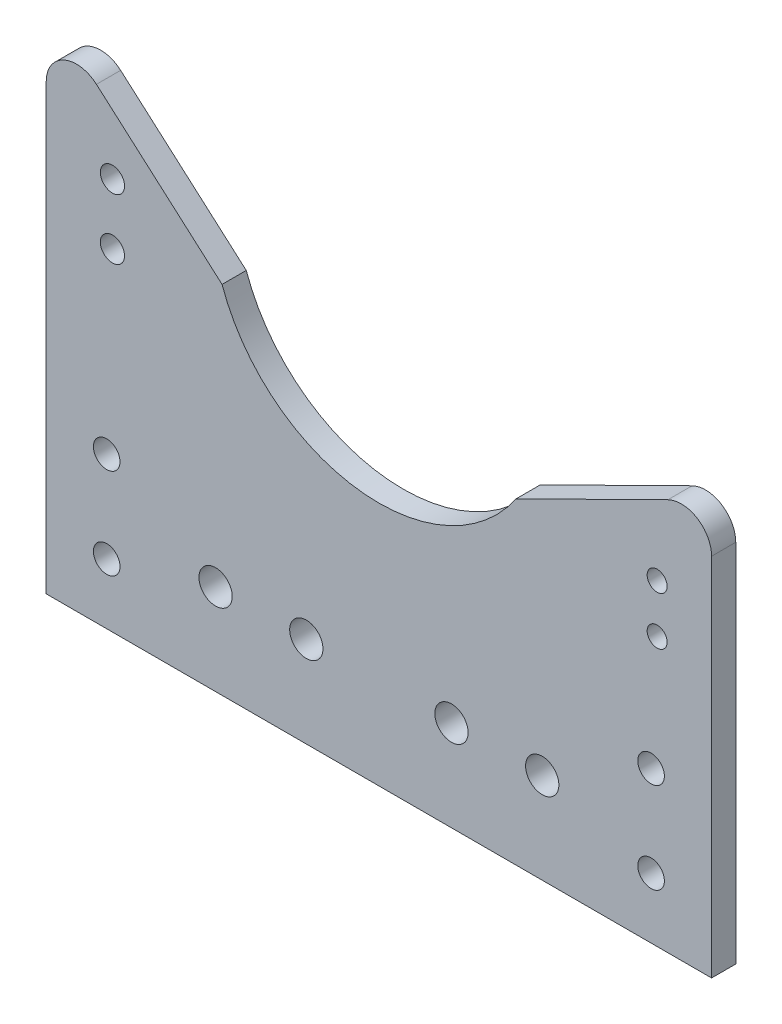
ISO-10303-21;
HEADER;
FILE_DESCRIPTION(('STEP AP214'),'2;1');
FILE_NAME('part.step','',(''),(''),'','','');
FILE_SCHEMA(('AUTOMOTIVE_DESIGN { 1 0 10303 214 1 1 1 1 }'));
ENDSEC;
DATA;
#1=APPLICATION_CONTEXT('core data for automotive mechanical design processes');
#2=APPLICATION_PROTOCOL_DEFINITION('international standard','automotive_design',2000,#1);
#3=PRODUCT_CONTEXT('',#1,'mechanical');
#4=PRODUCT('Part','Part','',(#3));
#5=PRODUCT_RELATED_PRODUCT_CATEGORY('part','',(#4));
#6=PRODUCT_DEFINITION_FORMATION('','',#4);
#7=PRODUCT_DEFINITION_CONTEXT('part definition',#1,'design');
#8=PRODUCT_DEFINITION('design','',#6,#7);
#9=PRODUCT_DEFINITION_SHAPE('','',#8);
#10=(LENGTH_UNIT() NAMED_UNIT(*) SI_UNIT(.MILLI.,.METRE.));
#11=(NAMED_UNIT(*) PLANE_ANGLE_UNIT() SI_UNIT($,.RADIAN.));
#12=(NAMED_UNIT(*) SI_UNIT($,.STERADIAN.) SOLID_ANGLE_UNIT());
#13=UNCERTAINTY_MEASURE_WITH_UNIT(LENGTH_MEASURE(1.E-05),#10,'distance_accuracy_value','');
#14=(GEOMETRIC_REPRESENTATION_CONTEXT(3) GLOBAL_UNCERTAINTY_ASSIGNED_CONTEXT((#13)) GLOBAL_UNIT_ASSIGNED_CONTEXT((#10,
#11,#12)) REPRESENTATION_CONTEXT('',''));
#15=CARTESIAN_POINT('',(0.,0.,0.));
#16=DIRECTION('',(0.,0.,1.));
#17=DIRECTION('',(1.,0.,0.));
#18=AXIS2_PLACEMENT_3D('',#15,#16,#17);
#19=CARTESIAN_POINT('',(50.,-7.61313324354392,2.));
#20=DIRECTION('',(0.,0.,1.));
#21=DIRECTION('',(1.,0.,0.));
#22=AXIS2_PLACEMENT_3D('',#19,#20,#21);
#23=CYLINDRICAL_SURFACE('',#22,5.);
#24=CARTESIAN_POINT('',(50.,-7.61313324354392,6.));
#25=DIRECTION('',(0.,0.,1.));
#26=DIRECTION('',(1.,0.,0.));
#27=AXIS2_PLACEMENT_3D('',#24,#25,#26);
#28=CIRCLE('',#27,5.);
#29=CARTESIAN_POINT('',(55.,-7.61313324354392,6.));
#30=VERTEX_POINT('',#29);
#31=CARTESIAN_POINT('',(47.7823330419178,-3.13184400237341,6.));
#32=VERTEX_POINT('',#31);
#33=EDGE_CURVE('E191',#30,#32,#28,.T.);
#34=ORIENTED_EDGE('',*,*,#33,.F.);
#35=DIRECTION('',(0.,0.,1.));
#36=VECTOR('',#35,1.);
#37=CARTESIAN_POINT('',(55.,-7.61313324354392,6.));
#38=LINE('',#37,#36);
#39=CARTESIAN_POINT('',(55.,-7.61313324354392,2.));
#40=VERTEX_POINT('',#39);
#41=EDGE_CURVE('E187',#40,#30,#38,.T.);
#42=ORIENTED_EDGE('',*,*,#41,.F.);
#43=CARTESIAN_POINT('',(50.,-7.61313324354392,2.));
#44=DIRECTION('',(0.,0.,-1.));
#45=DIRECTION('',(1.,0.,0.));
#46=AXIS2_PLACEMENT_3D('',#43,#44,#45);
#47=CIRCLE('',#46,5.);
#48=CARTESIAN_POINT('',(47.7823330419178,-3.13184400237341,2.));
#49=VERTEX_POINT('',#48);
#50=EDGE_CURVE('E11',#49,#40,#47,.T.);
#51=ORIENTED_EDGE('',*,*,#50,.F.);
#52=DIRECTION('',(0.,0.,-1.));
#53=VECTOR('',#52,1.);
#54=CARTESIAN_POINT('',(47.7823330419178,-3.13184400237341,2.));
#55=LINE('',#54,#53);
#56=EDGE_CURVE('E164',#32,#49,#55,.T.);
#57=ORIENTED_EDGE('',*,*,#56,.F.);
#58=EDGE_LOOP('',(#34,#42,#51,#57));
#59=FACE_BOUND('',#58,.T.);
#60=ADVANCED_FACE('F17',(#59),#23,.T.);
#61=CARTESIAN_POINT('',(-50.,5.35267143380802,6.));
#62=DIRECTION('',(0.,0.,-1.));
#63=DIRECTION('',(-1.,0.,0.));
#64=AXIS2_PLACEMENT_3D('',#61,#62,#63);
#65=CYLINDRICAL_SURFACE('',#64,5.);
#66=CARTESIAN_POINT('',(-50.,5.35267143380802,6.));
#67=DIRECTION('',(0.,0.,1.));
#68=DIRECTION('',(1.,0.,0.));
#69=AXIS2_PLACEMENT_3D('',#66,#67,#68);
#70=CIRCLE('',#69,5.);
#71=CARTESIAN_POINT('',(-46.6980552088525,9.10729000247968,6.));
#72=VERTEX_POINT('',#71);
#73=CARTESIAN_POINT('',(-55.,5.35267143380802,6.));
#74=VERTEX_POINT('',#73);
#75=EDGE_CURVE('E126',#72,#74,#70,.T.);
#76=ORIENTED_EDGE('',*,*,#75,.F.);
#77=DIRECTION('',(0.,0.,1.));
#78=VECTOR('',#77,1.);
#79=CARTESIAN_POINT('',(-46.6980552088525,9.10729000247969,2.));
#80=LINE('',#79,#78);
#81=CARTESIAN_POINT('',(-46.6980552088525,9.10729000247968,2.));
#82=VERTEX_POINT('',#81);
#83=EDGE_CURVE('E124',#82,#72,#80,.T.);
#84=ORIENTED_EDGE('',*,*,#83,.F.);
#85=CARTESIAN_POINT('',(-50.,5.35267143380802,2.));
#86=DIRECTION('',(0.,0.,-1.));
#87=DIRECTION('',(1.,0.,0.));
#88=AXIS2_PLACEMENT_3D('',#85,#86,#87);
#89=CIRCLE('',#88,5.);
#90=CARTESIAN_POINT('',(-55.,5.35267143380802,2.));
#91=VERTEX_POINT('',#90);
#92=EDGE_CURVE('E20',#91,#82,#89,.T.);
#93=ORIENTED_EDGE('',*,*,#92,.F.);
#94=DIRECTION('',(0.,0.,-1.));
#95=VECTOR('',#94,1.);
#96=CARTESIAN_POINT('',(-55.,5.35267143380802,6.));
#97=LINE('',#96,#95);
#98=EDGE_CURVE('E184',#74,#91,#97,.T.);
#99=ORIENTED_EDGE('',*,*,#98,.F.);
#100=EDGE_LOOP('',(#76,#84,#93,#99));
#101=FACE_BOUND('',#100,.T.);
#102=ADVANCED_FACE('F125',(#101),#65,.T.);
#103=CARTESIAN_POINT('',(0.,0.,2.));
#104=DIRECTION('',(0.,0.,1.));
#105=DIRECTION('',(1.,0.,0.));
#106=AXIS2_PLACEMENT_3D('',#103,#104,#105);
#107=PLANE('',#106);
#108=CARTESIAN_POINT('',(-27.,-53.,2.));
#109=DIRECTION('',(0.,0.,-1.));
#110=DIRECTION('',(1.,0.,0.));
#111=AXIS2_PLACEMENT_3D('',#108,#109,#110);
#112=CIRCLE('',#111,2.75);
#113=CARTESIAN_POINT('',(-24.25,-53.,2.));
#114=VERTEX_POINT('',#113);
#115=EDGE_CURVE('E146',#114,#114,#112,.T.);
#116=ORIENTED_EDGE('',*,*,#115,.F.);
#117=EDGE_LOOP('',(#116));
#118=FACE_BOUND('',#117,.T.);
#119=CARTESIAN_POINT('',(12.,-53.,2.));
#120=DIRECTION('',(0.,0.,-1.));
#121=DIRECTION('',(1.,0.,0.));
#122=AXIS2_PLACEMENT_3D('',#119,#120,#121);
#123=CIRCLE('',#122,2.75);
#124=CARTESIAN_POINT('',(14.75,-53.,2.));
#125=VERTEX_POINT('',#124);
#126=EDGE_CURVE('E270',#125,#125,#123,.T.);
#127=ORIENTED_EDGE('',*,*,#126,.F.);
#128=EDGE_LOOP('',(#127));
#129=FACE_BOUND('',#128,.T.);
#130=CARTESIAN_POINT('',(27.,-53.,2.));
#131=DIRECTION('',(0.,0.,-1.));
#132=DIRECTION('',(1.,0.,0.));
#133=AXIS2_PLACEMENT_3D('',#130,#131,#132);
#134=CIRCLE('',#133,2.75);
#135=CARTESIAN_POINT('',(29.75,-53.,2.));
#136=VERTEX_POINT('',#135);
#137=EDGE_CURVE('E260',#136,#136,#134,.T.);
#138=ORIENTED_EDGE('',*,*,#137,.F.);
#139=EDGE_LOOP('',(#138));
#140=FACE_BOUND('',#139,.T.);
#141=CARTESIAN_POINT('',(-12.,-53.,2.));
#142=DIRECTION('',(0.,0.,-1.));
#143=DIRECTION('',(1.,0.,0.));
#144=AXIS2_PLACEMENT_3D('',#141,#142,#143);
#145=CIRCLE('',#144,2.75);
#146=CARTESIAN_POINT('',(-9.25,-53.,2.));
#147=VERTEX_POINT('',#146);
#148=EDGE_CURVE('E231',#147,#147,#145,.T.);
#149=ORIENTED_EDGE('',*,*,#148,.F.);
#150=EDGE_LOOP('',(#149));
#151=FACE_BOUND('',#150,.T.);
#152=CARTESIAN_POINT('',(-45.,-43.,2.));
#153=DIRECTION('',(0.,0.,1.));
#154=DIRECTION('',(1.,0.,0.));
#155=AXIS2_PLACEMENT_3D('',#152,#153,#154);
#156=CIRCLE('',#155,2.2);
#157=CARTESIAN_POINT('',(-42.8,-43.,2.));
#158=VERTEX_POINT('',#157);
#159=EDGE_CURVE('E252',#158,#158,#156,.T.);
#160=ORIENTED_EDGE('',*,*,#159,.T.);
#161=EDGE_LOOP('',(#160));
#162=FACE_BOUND('',#161,.T.);
#163=CARTESIAN_POINT('',(-45.,-58.,2.));
#164=DIRECTION('',(0.,0.,1.));
#165=DIRECTION('',(1.,0.,0.));
#166=AXIS2_PLACEMENT_3D('',#163,#164,#165);
#167=CIRCLE('',#166,2.2);
#168=CARTESIAN_POINT('',(-42.8,-58.,2.));
#169=VERTEX_POINT('',#168);
#170=EDGE_CURVE('E244',#169,#169,#167,.T.);
#171=ORIENTED_EDGE('',*,*,#170,.T.);
#172=EDGE_LOOP('',(#171));
#173=FACE_BOUND('',#172,.T.);
#174=CARTESIAN_POINT('',(45.,-58.,2.));
#175=DIRECTION('',(0.,0.,1.));
#176=DIRECTION('',(-1.,0.,0.));
#177=AXIS2_PLACEMENT_3D('',#174,#175,#176);
#178=CIRCLE('',#177,2.2);
#179=CARTESIAN_POINT('',(42.8,-58.,2.));
#180=VERTEX_POINT('',#179);
#181=EDGE_CURVE('E230',#180,#180,#178,.T.);
#182=ORIENTED_EDGE('',*,*,#181,.T.);
#183=EDGE_LOOP('',(#182));
#184=FACE_BOUND('',#183,.T.);
#185=CARTESIAN_POINT('',(45.,-43.,2.));
#186=DIRECTION('',(0.,0.,1.));
#187=DIRECTION('',(-1.,0.,0.));
#188=AXIS2_PLACEMENT_3D('',#185,#186,#187);
#189=CIRCLE('',#188,2.2);
#190=CARTESIAN_POINT('',(42.8,-43.,2.));
#191=VERTEX_POINT('',#190);
#192=EDGE_CURVE('E222',#191,#191,#189,.T.);
#193=ORIENTED_EDGE('',*,*,#192,.T.);
#194=EDGE_LOOP('',(#193));
#195=FACE_BOUND('',#194,.T.);
#196=CARTESIAN_POINT('',(-44.0547008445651,-3.14732856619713,2.));
#197=DIRECTION('',(0.,0.,-1.));
#198=DIRECTION('',(-1.,0.,0.));
#199=AXIS2_PLACEMENT_3D('',#196,#197,#198);
#200=CIRCLE('',#199,2.);
#201=CARTESIAN_POINT('',(-46.0547008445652,-3.14732856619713,2.));
#202=VERTEX_POINT('',#201);
#203=EDGE_CURVE('E221',#202,#202,#200,.T.);
#204=ORIENTED_EDGE('',*,*,#203,.F.);
#205=EDGE_LOOP('',(#204));
#206=FACE_BOUND('',#205,.T.);
#207=CARTESIAN_POINT('',(-44.0547008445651,-13.1473285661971,2.));
#208=DIRECTION('',(0.,0.,-1.));
#209=DIRECTION('',(-1.,0.,0.));
#210=AXIS2_PLACEMENT_3D('',#207,#208,#209);
#211=CIRCLE('',#210,2.);
#212=CARTESIAN_POINT('',(-46.0547008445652,-13.1473285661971,2.));
#213=VERTEX_POINT('',#212);
#214=EDGE_CURVE('E213',#213,#213,#211,.T.);
#215=ORIENTED_EDGE('',*,*,#214,.F.);
#216=EDGE_LOOP('',(#215));
#217=FACE_BOUND('',#216,.T.);
#218=CARTESIAN_POINT('',(45.9999999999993,-15.6131332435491,2.));
#219=DIRECTION('',(0.,0.,-1.));
#220=DIRECTION('',(-1.,0.,0.));
#221=AXIS2_PLACEMENT_3D('',#218,#219,#220);
#222=CIRCLE('',#221,1.65);
#223=CARTESIAN_POINT('',(44.3499999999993,-15.6131332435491,2.));
#224=VERTEX_POINT('',#223);
#225=EDGE_CURVE('E207',#224,#224,#222,.T.);
#226=ORIENTED_EDGE('',*,*,#225,.F.);
#227=EDGE_LOOP('',(#226));
#228=FACE_BOUND('',#227,.T.);
#229=CARTESIAN_POINT('',(45.9999999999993,-23.6131332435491,2.));
#230=DIRECTION('',(0.,0.,-1.));
#231=DIRECTION('',(-1.,0.,0.));
#232=AXIS2_PLACEMENT_3D('',#229,#230,#231);
#233=CIRCLE('',#232,1.65);
#234=CARTESIAN_POINT('',(44.3499999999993,-23.6131332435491,2.));
#235=VERTEX_POINT('',#234);
#236=EDGE_CURVE('E314',#235,#235,#233,.T.);
#237=ORIENTED_EDGE('',*,*,#236,.F.);
#238=EDGE_LOOP('',(#237));
#239=FACE_BOUND('',#238,.T.);
#240=DIRECTION('',(0.,-1.,0.));
#241=VECTOR('',#240,1.);
#242=CARTESIAN_POINT('',(-55.,16.4083148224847,2.));
#243=LINE('',#242,#241);
#244=CARTESIAN_POINT('',(-55.,-68.,2.));
#245=VERTEX_POINT('',#244);
#246=EDGE_CURVE('E120',#91,#245,#243,.T.);
#247=ORIENTED_EDGE('',*,*,#246,.F.);
#248=ORIENTED_EDGE('',*,*,#92,.T.);
#249=DIRECTION('',(-0.750923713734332,0.660388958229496,0.));
#250=VECTOR('',#249,1.);
#251=CARTESIAN_POINT('',(-25.9310277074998,-9.15597084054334,2.));
#252=LINE('',#251,#250);
#253=CARTESIAN_POINT('',(-25.9310277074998,-9.15597084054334,2.));
#254=VERTEX_POINT('',#253);
#255=EDGE_CURVE('E118',#254,#82,#252,.T.);
#256=ORIENTED_EDGE('',*,*,#255,.F.);
#257=CARTESIAN_POINT('',(0.,0.,2.));
#258=DIRECTION('',(0.,0.,-1.));
#259=DIRECTION('',(1.,0.,0.));
#260=AXIS2_PLACEMENT_3D('',#257,#258,#259);
#261=CIRCLE('',#260,27.5);
#262=CARTESIAN_POINT('',(22.6777097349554,-15.5554325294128,2.));
#263=VERTEX_POINT('',#262);
#264=EDGE_CURVE('E175',#263,#254,#261,.T.);
#265=ORIENTED_EDGE('',*,*,#264,.F.);
#266=DIRECTION('',(-0.896257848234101,-0.443533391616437,0.));
#267=VECTOR('',#266,1.);
#268=CARTESIAN_POINT('',(55.,0.439981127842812,2.));
#269=LINE('',#268,#267);
#270=EDGE_CURVE('E170',#49,#263,#269,.T.);
#271=ORIENTED_EDGE('',*,*,#270,.F.);
#272=ORIENTED_EDGE('',*,*,#50,.T.);
#273=DIRECTION('',(0.,1.,0.));
#274=VECTOR('',#273,1.);
#275=CARTESIAN_POINT('',(55.,-68.,2.));
#276=LINE('',#275,#274);
#277=CARTESIAN_POINT('',(55.,-68.,2.));
#278=VERTEX_POINT('',#277);
#279=EDGE_CURVE('E193',#278,#40,#276,.T.);
#280=ORIENTED_EDGE('',*,*,#279,.F.);
#281=DIRECTION('',(1.,0.,0.));
#282=VECTOR('',#281,1.);
#283=CARTESIAN_POINT('',(-55.,-68.,2.));
#284=LINE('',#283,#282);
#285=EDGE_CURVE('E150',#245,#278,#284,.T.);
#286=ORIENTED_EDGE('',*,*,#285,.F.);
#287=EDGE_LOOP('',(#247,#248,#256,#265,#271,#272,#280,#286));
#288=FACE_BOUND('',#287,.T.);
#289=ADVANCED_FACE('F116',(#118,#129,#140,#151,#162,#173,#184,#195,#206,#217,#228,#239,#288),
#107,.F.);
#290=CARTESIAN_POINT('',(-55.,16.4083148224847,6.));
#291=DIRECTION('',(1.,0.,0.));
#292=DIRECTION('',(0.,1.,0.));
#293=AXIS2_PLACEMENT_3D('',#290,#291,#292);
#294=PLANE('',#293);
#295=DIRECTION('',(0.,-1.,0.));
#296=VECTOR('',#295,1.);
#297=CARTESIAN_POINT('',(-55.,16.4083148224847,6.));
#298=LINE('',#297,#296);
#299=CARTESIAN_POINT('',(-55.,-68.,6.));
#300=VERTEX_POINT('',#299);
#301=EDGE_CURVE('E105',#74,#300,#298,.T.);
#302=ORIENTED_EDGE('',*,*,#301,.F.);
#303=ORIENTED_EDGE('',*,*,#98,.T.);
#304=ORIENTED_EDGE('',*,*,#246,.T.);
#305=DIRECTION('',(0.,0.,-1.));
#306=VECTOR('',#305,1.);
#307=CARTESIAN_POINT('',(-55.,-68.,6.));
#308=LINE('',#307,#306);
#309=EDGE_CURVE('E183',#300,#245,#308,.T.);
#310=ORIENTED_EDGE('',*,*,#309,.F.);
#311=EDGE_LOOP('',(#302,#303,#304,#310));
#312=FACE_BOUND('',#311,.T.);
#313=ADVANCED_FACE('F290',(#312),#294,.F.);
#314=CARTESIAN_POINT('',(55.,-68.,6.));
#315=DIRECTION('',(-1.,0.,0.));
#316=DIRECTION('',(0.,0.,1.));
#317=AXIS2_PLACEMENT_3D('',#314,#315,#316);
#318=PLANE('',#317);
#319=ORIENTED_EDGE('',*,*,#279,.T.);
#320=ORIENTED_EDGE('',*,*,#41,.T.);
#321=DIRECTION('',(0.,1.,0.));
#322=VECTOR('',#321,1.);
#323=CARTESIAN_POINT('',(55.,-68.,6.));
#324=LINE('',#323,#322);
#325=CARTESIAN_POINT('',(55.,-68.,6.));
#326=VERTEX_POINT('',#325);
#327=EDGE_CURVE('E93',#326,#30,#324,.T.);
#328=ORIENTED_EDGE('',*,*,#327,.F.);
#329=DIRECTION('',(0.,0.,-1.));
#330=VECTOR('',#329,1.);
#331=CARTESIAN_POINT('',(55.,-68.,6.));
#332=LINE('',#331,#330);
#333=EDGE_CURVE('E154',#326,#278,#332,.T.);
#334=ORIENTED_EDGE('',*,*,#333,.T.);
#335=EDGE_LOOP('',(#319,#320,#328,#334));
#336=FACE_BOUND('',#335,.T.);
#337=ADVANCED_FACE('F338',(#336),#318,.F.);
#338=CARTESIAN_POINT('',(0.,0.,6.));
#339=DIRECTION('',(0.,0.,1.));
#340=DIRECTION('',(1.,0.,0.));
#341=AXIS2_PLACEMENT_3D('',#338,#339,#340);
#342=PLANE('',#341);
#343=CARTESIAN_POINT('',(-27.,-53.,6.));
#344=DIRECTION('',(0.,0.,1.));
#345=DIRECTION('',(1.,0.,0.));
#346=AXIS2_PLACEMENT_3D('',#343,#344,#345);
#347=CIRCLE('',#346,2.75);
#348=CARTESIAN_POINT('',(-24.25,-53.,6.));
#349=VERTEX_POINT('',#348);
#350=EDGE_CURVE('E138',#349,#349,#347,.T.);
#351=ORIENTED_EDGE('',*,*,#350,.F.);
#352=EDGE_LOOP('',(#351));
#353=FACE_BOUND('',#352,.T.);
#354=CARTESIAN_POINT('',(-12.,-53.,6.));
#355=DIRECTION('',(0.,0.,1.));
#356=DIRECTION('',(1.,0.,0.));
#357=AXIS2_PLACEMENT_3D('',#354,#355,#356);
#358=CIRCLE('',#357,2.75);
#359=CARTESIAN_POINT('',(-9.25,-53.,6.));
#360=VERTEX_POINT('',#359);
#361=EDGE_CURVE('E235',#360,#360,#358,.T.);
#362=ORIENTED_EDGE('',*,*,#361,.F.);
#363=EDGE_LOOP('',(#362));
#364=FACE_BOUND('',#363,.T.);
#365=CARTESIAN_POINT('',(12.,-53.,6.));
#366=DIRECTION('',(0.,0.,1.));
#367=DIRECTION('',(1.,0.,0.));
#368=AXIS2_PLACEMENT_3D('',#365,#366,#367);
#369=CIRCLE('',#368,2.75);
#370=CARTESIAN_POINT('',(14.75,-53.,6.));
#371=VERTEX_POINT('',#370);
#372=EDGE_CURVE('E236',#371,#371,#369,.T.);
#373=ORIENTED_EDGE('',*,*,#372,.F.);
#374=EDGE_LOOP('',(#373));
#375=FACE_BOUND('',#374,.T.);
#376=CARTESIAN_POINT('',(27.,-53.,6.));
#377=DIRECTION('',(0.,0.,1.));
#378=DIRECTION('',(1.,0.,0.));
#379=AXIS2_PLACEMENT_3D('',#376,#377,#378);
#380=CIRCLE('',#379,2.75);
#381=CARTESIAN_POINT('',(29.75,-53.,6.));
#382=VERTEX_POINT('',#381);
#383=EDGE_CURVE('E267',#382,#382,#380,.T.);
#384=ORIENTED_EDGE('',*,*,#383,.F.);
#385=EDGE_LOOP('',(#384));
#386=FACE_BOUND('',#385,.T.);
#387=CARTESIAN_POINT('',(-45.,-43.,6.));
#388=DIRECTION('',(0.,0.,1.));
#389=DIRECTION('',(1.,0.,0.));
#390=AXIS2_PLACEMENT_3D('',#387,#388,#389);
#391=CIRCLE('',#390,2.2);
#392=CARTESIAN_POINT('',(-42.8,-43.,6.));
#393=VERTEX_POINT('',#392);
#394=EDGE_CURVE('E256',#393,#393,#391,.T.);
#395=ORIENTED_EDGE('',*,*,#394,.F.);
#396=EDGE_LOOP('',(#395));
#397=FACE_BOUND('',#396,.T.);
#398=CARTESIAN_POINT('',(-45.,-58.,6.));
#399=DIRECTION('',(0.,0.,1.));
#400=DIRECTION('',(1.,0.,0.));
#401=AXIS2_PLACEMENT_3D('',#398,#399,#400);
#402=CIRCLE('',#401,2.2);
#403=CARTESIAN_POINT('',(-42.8,-58.,6.));
#404=VERTEX_POINT('',#403);
#405=EDGE_CURVE('E248',#404,#404,#402,.T.);
#406=ORIENTED_EDGE('',*,*,#405,.F.);
#407=EDGE_LOOP('',(#406));
#408=FACE_BOUND('',#407,.T.);
#409=CARTESIAN_POINT('',(45.,-58.,6.));
#410=DIRECTION('',(0.,0.,1.));
#411=DIRECTION('',(-1.,0.,0.));
#412=AXIS2_PLACEMENT_3D('',#409,#410,#411);
#413=CIRCLE('',#412,2.2);
#414=CARTESIAN_POINT('',(42.8,-58.,6.));
#415=VERTEX_POINT('',#414);
#416=EDGE_CURVE('E240',#415,#415,#413,.T.);
#417=ORIENTED_EDGE('',*,*,#416,.F.);
#418=EDGE_LOOP('',(#417));
#419=FACE_BOUND('',#418,.T.);
#420=CARTESIAN_POINT('',(45.,-43.,6.));
#421=DIRECTION('',(0.,0.,1.));
#422=DIRECTION('',(-1.,0.,0.));
#423=AXIS2_PLACEMENT_3D('',#420,#421,#422);
#424=CIRCLE('',#423,2.2);
#425=CARTESIAN_POINT('',(42.8,-43.,6.));
#426=VERTEX_POINT('',#425);
#427=EDGE_CURVE('E226',#426,#426,#424,.T.);
#428=ORIENTED_EDGE('',*,*,#427,.F.);
#429=EDGE_LOOP('',(#428));
#430=FACE_BOUND('',#429,.T.);
#431=CARTESIAN_POINT('',(-44.0547008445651,-3.14732856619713,6.));
#432=DIRECTION('',(0.,0.,1.));
#433=DIRECTION('',(1.,0.,0.));
#434=AXIS2_PLACEMENT_3D('',#431,#432,#433);
#435=CIRCLE('',#434,2.);
#436=CARTESIAN_POINT('',(-42.0547008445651,-3.14732856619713,6.));
#437=VERTEX_POINT('',#436);
#438=EDGE_CURVE('E217',#437,#437,#435,.T.);
#439=ORIENTED_EDGE('',*,*,#438,.F.);
#440=EDGE_LOOP('',(#439));
#441=FACE_BOUND('',#440,.T.);
#442=CARTESIAN_POINT('',(-44.0547008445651,-13.1473285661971,6.));
#443=DIRECTION('',(0.,0.,1.));
#444=DIRECTION('',(1.,0.,0.));
#445=AXIS2_PLACEMENT_3D('',#442,#443,#444);
#446=CIRCLE('',#445,2.);
#447=CARTESIAN_POINT('',(-42.0547008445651,-13.1473285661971,6.));
#448=VERTEX_POINT('',#447);
#449=EDGE_CURVE('E211',#448,#448,#446,.T.);
#450=ORIENTED_EDGE('',*,*,#449,.F.);
#451=EDGE_LOOP('',(#450));
#452=FACE_BOUND('',#451,.T.);
#453=CARTESIAN_POINT('',(45.9999999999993,-15.6131332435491,6.));
#454=DIRECTION('',(0.,0.,1.));
#455=DIRECTION('',(1.,0.,0.));
#456=AXIS2_PLACEMENT_3D('',#453,#454,#455);
#457=CIRCLE('',#456,1.65);
#458=CARTESIAN_POINT('',(47.6499999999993,-15.6131332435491,6.));
#459=VERTEX_POINT('',#458);
#460=EDGE_CURVE('E212',#459,#459,#457,.T.);
#461=ORIENTED_EDGE('',*,*,#460,.F.);
#462=EDGE_LOOP('',(#461));
#463=FACE_BOUND('',#462,.T.);
#464=CARTESIAN_POINT('',(45.9999999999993,-23.6131332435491,6.));
#465=DIRECTION('',(0.,0.,1.));
#466=DIRECTION('',(1.,0.,0.));
#467=AXIS2_PLACEMENT_3D('',#464,#465,#466);
#468=CIRCLE('',#467,1.65);
#469=CARTESIAN_POINT('',(47.6499999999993,-23.6131332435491,6.));
#470=VERTEX_POINT('',#469);
#471=EDGE_CURVE('E317',#470,#470,#468,.T.);
#472=ORIENTED_EDGE('',*,*,#471,.F.);
#473=EDGE_LOOP('',(#472));
#474=FACE_BOUND('',#473,.T.);
#475=DIRECTION('',(-0.750923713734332,0.660388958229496,0.));
#476=VECTOR('',#475,1.);
#477=CARTESIAN_POINT('',(-25.9310277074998,-9.15597084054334,6.));
#478=LINE('',#477,#476);
#479=CARTESIAN_POINT('',(-25.9310277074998,-9.15597084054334,6.));
#480=VERTEX_POINT('',#479);
#481=EDGE_CURVE('E131',#480,#72,#478,.T.);
#482=ORIENTED_EDGE('',*,*,#481,.T.);
#483=ORIENTED_EDGE('',*,*,#75,.T.);
#484=ORIENTED_EDGE('',*,*,#301,.T.);
#485=DIRECTION('',(1.,0.,0.));
#486=VECTOR('',#485,1.);
#487=CARTESIAN_POINT('',(-55.,-68.,6.));
#488=LINE('',#487,#486);
#489=EDGE_CURVE('E180',#300,#326,#488,.T.);
#490=ORIENTED_EDGE('',*,*,#489,.T.);
#491=ORIENTED_EDGE('',*,*,#327,.T.);
#492=ORIENTED_EDGE('',*,*,#33,.T.);
#493=DIRECTION('',(-0.896257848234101,-0.443533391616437,0.));
#494=VECTOR('',#493,1.);
#495=CARTESIAN_POINT('',(55.,0.439981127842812,6.));
#496=LINE('',#495,#494);
#497=CARTESIAN_POINT('',(22.6777097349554,-15.5554325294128,6.));
#498=VERTEX_POINT('',#497);
#499=EDGE_CURVE('E160',#32,#498,#496,.T.);
#500=ORIENTED_EDGE('',*,*,#499,.T.);
#501=CARTESIAN_POINT('',(0.,0.,6.));
#502=DIRECTION('',(0.,0.,-1.));
#503=DIRECTION('',(1.,0.,0.));
#504=AXIS2_PLACEMENT_3D('',#501,#502,#503);
#505=CIRCLE('',#504,27.5);
#506=EDGE_CURVE('E155',#498,#480,#505,.T.);
#507=ORIENTED_EDGE('',*,*,#506,.T.);
#508=EDGE_LOOP('',(#482,#483,#484,#490,#491,#492,#500,#507));
#509=FACE_BOUND('',#508,.T.);
#510=ADVANCED_FACE('F595',(#353,#364,#375,#386,#397,#408,#419,#430,#441,#452,#463,#474,#509),
#342,.T.);
#511=CARTESIAN_POINT('',(0.,-68.,-5.5));
#512=DIRECTION('',(0.,-1.,0.));
#513=DIRECTION('',(0.,0.,-1.));
#514=AXIS2_PLACEMENT_3D('',#511,#512,#513);
#515=PLANE('',#514);
#516=ORIENTED_EDGE('',*,*,#285,.T.);
#517=ORIENTED_EDGE('',*,*,#333,.F.);
#518=ORIENTED_EDGE('',*,*,#489,.F.);
#519=ORIENTED_EDGE('',*,*,#309,.T.);
#520=EDGE_LOOP('',(#516,#517,#518,#519));
#521=FACE_BOUND('',#520,.T.);
#522=ADVANCED_FACE('F341',(#521),#515,.T.);
#523=CARTESIAN_POINT('',(0.,0.,2.));
#524=DIRECTION('',(0.,0.,-1.));
#525=DIRECTION('',(-1.,0.,0.));
#526=AXIS2_PLACEMENT_3D('',#523,#524,#525);
#527=CYLINDRICAL_SURFACE('',#526,27.5);
#528=ORIENTED_EDGE('',*,*,#264,.T.);
#529=DIRECTION('',(0.,0.,-1.));
#530=VECTOR('',#529,1.);
#531=CARTESIAN_POINT('',(-25.9310277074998,-9.15597084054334,2.));
#532=LINE('',#531,#530);
#533=EDGE_CURVE('E136',#480,#254,#532,.T.);
#534=ORIENTED_EDGE('',*,*,#533,.F.);
#535=ORIENTED_EDGE('',*,*,#506,.F.);
#536=DIRECTION('',(0.,0.,-1.));
#537=VECTOR('',#536,1.);
#538=CARTESIAN_POINT('',(22.6777097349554,-15.5554325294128,2.));
#539=LINE('',#538,#537);
#540=EDGE_CURVE('E174',#498,#263,#539,.T.);
#541=ORIENTED_EDGE('',*,*,#540,.T.);
#542=EDGE_LOOP('',(#528,#534,#535,#541));
#543=FACE_BOUND('',#542,.T.);
#544=ADVANCED_FACE('F594',(#543),#527,.F.);
#545=CARTESIAN_POINT('',(10.6448013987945,-21.5101883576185,2.));
#546=DIRECTION('',(-0.443533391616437,0.896257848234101,0.));
#547=DIRECTION('',(0.,0.,1.));
#548=AXIS2_PLACEMENT_3D('',#545,#546,#547);
#549=PLANE('',#548);
#550=ORIENTED_EDGE('',*,*,#499,.F.);
#551=ORIENTED_EDGE('',*,*,#56,.T.);
#552=ORIENTED_EDGE('',*,*,#270,.T.);
#553=ORIENTED_EDGE('',*,*,#540,.F.);
#554=EDGE_LOOP('',(#550,#551,#552,#553));
#555=FACE_BOUND('',#554,.T.);
#556=ADVANCED_FACE('F630',(#555),#549,.T.);
#557=CARTESIAN_POINT('',(-15.8493349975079,-18.022169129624,2.));
#558=DIRECTION('',(-0.660388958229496,-0.750923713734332,0.));
#559=DIRECTION('',(-0.750923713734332,0.660388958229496,0.));
#560=AXIS2_PLACEMENT_3D('',#557,#558,#559);
#561=PLANE('',#560);
#562=ORIENTED_EDGE('',*,*,#255,.T.);
#563=ORIENTED_EDGE('',*,*,#83,.T.);
#564=ORIENTED_EDGE('',*,*,#481,.F.);
#565=ORIENTED_EDGE('',*,*,#533,.T.);
#566=EDGE_LOOP('',(#562,#563,#564,#565));
#567=FACE_BOUND('',#566,.T.);
#568=ADVANCED_FACE('F134',(#567),#561,.F.);
#569=CARTESIAN_POINT('',(-27.,-53.,-5.5));
#570=DIRECTION('',(0.,0.,1.));
#571=DIRECTION('',(1.,0.,0.));
#572=AXIS2_PLACEMENT_3D('',#569,#570,#571);
#573=CYLINDRICAL_SURFACE('',#572,2.75);
#574=ORIENTED_EDGE('',*,*,#350,.T.);
#575=EDGE_LOOP('',(#574));
#576=FACE_BOUND('',#575,.T.);
#577=ORIENTED_EDGE('',*,*,#115,.T.);
#578=EDGE_LOOP('',(#577));
#579=FACE_BOUND('',#578,.T.);
#580=ADVANCED_FACE('F286',(#576,#579),#573,.F.);
#581=CARTESIAN_POINT('',(-12.,-53.,-5.5));
#582=DIRECTION('',(0.,0.,1.));
#583=DIRECTION('',(1.,0.,0.));
#584=AXIS2_PLACEMENT_3D('',#581,#582,#583);
#585=CYLINDRICAL_SURFACE('',#584,2.75);
#586=ORIENTED_EDGE('',*,*,#361,.T.);
#587=EDGE_LOOP('',(#586));
#588=FACE_BOUND('',#587,.T.);
#589=ORIENTED_EDGE('',*,*,#148,.T.);
#590=EDGE_LOOP('',(#589));
#591=FACE_BOUND('',#590,.T.);
#592=ADVANCED_FACE('F605',(#588,#591),#585,.F.);
#593=CARTESIAN_POINT('',(12.,-53.,-5.5));
#594=DIRECTION('',(0.,0.,1.));
#595=DIRECTION('',(1.,0.,0.));
#596=AXIS2_PLACEMENT_3D('',#593,#594,#595);
#597=CYLINDRICAL_SURFACE('',#596,2.75);
#598=ORIENTED_EDGE('',*,*,#372,.T.);
#599=EDGE_LOOP('',(#598));
#600=FACE_BOUND('',#599,.T.);
#601=ORIENTED_EDGE('',*,*,#126,.T.);
#602=EDGE_LOOP('',(#601));
#603=FACE_BOUND('',#602,.T.);
#604=ADVANCED_FACE('F600',(#600,#603),#597,.F.);
#605=CARTESIAN_POINT('',(27.,-53.,-5.5));
#606=DIRECTION('',(0.,0.,1.));
#607=DIRECTION('',(1.,0.,0.));
#608=AXIS2_PLACEMENT_3D('',#605,#606,#607);
#609=CYLINDRICAL_SURFACE('',#608,2.75);
#610=ORIENTED_EDGE('',*,*,#383,.T.);
#611=EDGE_LOOP('',(#610));
#612=FACE_BOUND('',#611,.T.);
#613=ORIENTED_EDGE('',*,*,#137,.T.);
#614=EDGE_LOOP('',(#613));
#615=FACE_BOUND('',#614,.T.);
#616=ADVANCED_FACE('F604',(#612,#615),#609,.F.);
#617=CARTESIAN_POINT('',(-45.,-43.,2.));
#618=DIRECTION('',(0.,0.,1.));
#619=DIRECTION('',(1.,0.,0.));
#620=AXIS2_PLACEMENT_3D('',#617,#618,#619);
#621=CYLINDRICAL_SURFACE('',#620,2.2);
#622=ORIENTED_EDGE('',*,*,#394,.T.);
#623=EDGE_LOOP('',(#622));
#624=FACE_BOUND('',#623,.T.);
#625=ORIENTED_EDGE('',*,*,#159,.F.);
#626=EDGE_LOOP('',(#625));
#627=FACE_BOUND('',#626,.T.);
#628=ADVANCED_FACE('F636',(#624,#627),#621,.F.);
#629=CARTESIAN_POINT('',(-45.,-58.,2.));
#630=DIRECTION('',(0.,0.,1.));
#631=DIRECTION('',(1.,0.,0.));
#632=AXIS2_PLACEMENT_3D('',#629,#630,#631);
#633=CYLINDRICAL_SURFACE('',#632,2.2);
#634=ORIENTED_EDGE('',*,*,#405,.T.);
#635=EDGE_LOOP('',(#634));
#636=FACE_BOUND('',#635,.T.);
#637=ORIENTED_EDGE('',*,*,#170,.F.);
#638=EDGE_LOOP('',(#637));
#639=FACE_BOUND('',#638,.T.);
#640=ADVANCED_FACE('F640',(#636,#639),#633,.F.);
#641=CARTESIAN_POINT('',(45.,-58.,2.));
#642=DIRECTION('',(0.,0.,1.));
#643=DIRECTION('',(1.,0.,0.));
#644=AXIS2_PLACEMENT_3D('',#641,#642,#643);
#645=CYLINDRICAL_SURFACE('',#644,2.2);
#646=ORIENTED_EDGE('',*,*,#416,.T.);
#647=EDGE_LOOP('',(#646));
#648=FACE_BOUND('',#647,.T.);
#649=ORIENTED_EDGE('',*,*,#181,.F.);
#650=EDGE_LOOP('',(#649));
#651=FACE_BOUND('',#650,.T.);
#652=ADVANCED_FACE('F666',(#648,#651),#645,.F.);
#653=CARTESIAN_POINT('',(45.,-43.,2.));
#654=DIRECTION('',(0.,0.,1.));
#655=DIRECTION('',(1.,0.,0.));
#656=AXIS2_PLACEMENT_3D('',#653,#654,#655);
#657=CYLINDRICAL_SURFACE('',#656,2.2);
#658=ORIENTED_EDGE('',*,*,#427,.T.);
#659=EDGE_LOOP('',(#658));
#660=FACE_BOUND('',#659,.T.);
#661=ORIENTED_EDGE('',*,*,#192,.F.);
#662=EDGE_LOOP('',(#661));
#663=FACE_BOUND('',#662,.T.);
#664=ADVANCED_FACE('F649',(#660,#663),#657,.F.);
#665=CARTESIAN_POINT('',(-44.0547008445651,-3.14732856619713,12.));
#666=DIRECTION('',(0.,0.,-1.));
#667=DIRECTION('',(-1.,0.,0.));
#668=AXIS2_PLACEMENT_3D('',#665,#666,#667);
#669=CYLINDRICAL_SURFACE('',#668,2.);
#670=ORIENTED_EDGE('',*,*,#203,.T.);
#671=EDGE_LOOP('',(#670));
#672=FACE_BOUND('',#671,.T.);
#673=ORIENTED_EDGE('',*,*,#438,.T.);
#674=EDGE_LOOP('',(#673));
#675=FACE_BOUND('',#674,.T.);
#676=ADVANCED_FACE('F621',(#672,#675),#669,.F.);
#677=CARTESIAN_POINT('',(-44.0547008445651,-13.1473285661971,12.));
#678=DIRECTION('',(0.,0.,-1.));
#679=DIRECTION('',(-1.,0.,0.));
#680=AXIS2_PLACEMENT_3D('',#677,#678,#679);
#681=CYLINDRICAL_SURFACE('',#680,2.);
#682=ORIENTED_EDGE('',*,*,#214,.T.);
#683=EDGE_LOOP('',(#682));
#684=FACE_BOUND('',#683,.T.);
#685=ORIENTED_EDGE('',*,*,#449,.T.);
#686=EDGE_LOOP('',(#685));
#687=FACE_BOUND('',#686,.T.);
#688=ADVANCED_FACE('F585',(#684,#687),#681,.F.);
#689=CARTESIAN_POINT('',(45.9999999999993,-15.6131332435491,12.));
#690=DIRECTION('',(0.,0.,-1.));
#691=DIRECTION('',(-1.,0.,0.));
#692=AXIS2_PLACEMENT_3D('',#689,#690,#691);
#693=CYLINDRICAL_SURFACE('',#692,1.65);
#694=ORIENTED_EDGE('',*,*,#225,.T.);
#695=EDGE_LOOP('',(#694));
#696=FACE_BOUND('',#695,.T.);
#697=ORIENTED_EDGE('',*,*,#460,.T.);
#698=EDGE_LOOP('',(#697));
#699=FACE_BOUND('',#698,.T.);
#700=ADVANCED_FACE('F578',(#696,#699),#693,.F.);
#701=CARTESIAN_POINT('',(45.9999999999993,-23.6131332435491,12.));
#702=DIRECTION('',(0.,0.,-1.));
#703=DIRECTION('',(-1.,0.,0.));
#704=AXIS2_PLACEMENT_3D('',#701,#702,#703);
#705=CYLINDRICAL_SURFACE('',#704,1.65);
#706=ORIENTED_EDGE('',*,*,#236,.T.);
#707=EDGE_LOOP('',(#706));
#708=FACE_BOUND('',#707,.T.);
#709=ORIENTED_EDGE('',*,*,#471,.T.);
#710=EDGE_LOOP('',(#709));
#711=FACE_BOUND('',#710,.T.);
#712=ADVANCED_FACE('F574',(#708,#711),#705,.F.);
#713=CLOSED_SHELL('',(#60,#102,#289,#313,#337,#510,#522,#544,#556,#568,#580,#592,#604,#616,#628,
#640,#652,#664,#676,#688,#700,#712));
#714=MANIFOLD_SOLID_BREP('B1',#713);
#715=ADVANCED_BREP_SHAPE_REPRESENTATION('',(#18,#714),#14);
#716=SHAPE_DEFINITION_REPRESENTATION(#9,#715);
ENDSEC;
END-ISO-10303-21;
